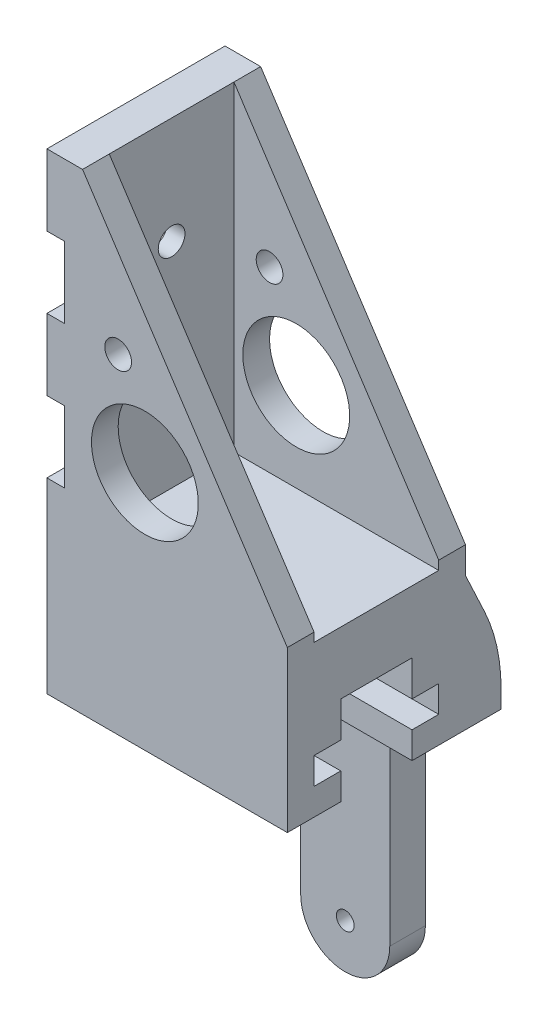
ISO-10303-21;
HEADER;
FILE_DESCRIPTION(('STEP AP214'),'2;1');
FILE_NAME('part.step','',(''),(''),'','','');
FILE_SCHEMA(('AUTOMOTIVE_DESIGN { 1 0 10303 214 1 1 1 1 }'));
ENDSEC;
DATA;
#1=APPLICATION_CONTEXT('core data for automotive mechanical design processes');
#2=APPLICATION_PROTOCOL_DEFINITION('international standard','automotive_design',2000,#1);
#3=PRODUCT_CONTEXT('',#1,'mechanical');
#4=PRODUCT('Part','Part','',(#3));
#5=PRODUCT_RELATED_PRODUCT_CATEGORY('part','',(#4));
#6=PRODUCT_DEFINITION_FORMATION('','',#4);
#7=PRODUCT_DEFINITION_CONTEXT('part definition',#1,'design');
#8=PRODUCT_DEFINITION('design','',#6,#7);
#9=PRODUCT_DEFINITION_SHAPE('','',#8);
#10=(LENGTH_UNIT() NAMED_UNIT(*) SI_UNIT(.MILLI.,.METRE.));
#11=(NAMED_UNIT(*) PLANE_ANGLE_UNIT() SI_UNIT($,.RADIAN.));
#12=(NAMED_UNIT(*) SI_UNIT($,.STERADIAN.) SOLID_ANGLE_UNIT());
#13=UNCERTAINTY_MEASURE_WITH_UNIT(LENGTH_MEASURE(1.E-05),#10,'distance_accuracy_value','');
#14=(GEOMETRIC_REPRESENTATION_CONTEXT(3) GLOBAL_UNCERTAINTY_ASSIGNED_CONTEXT((#13)) GLOBAL_UNIT_ASSIGNED_CONTEXT((#10,
#11,#12)) REPRESENTATION_CONTEXT('',''));
#15=CARTESIAN_POINT('',(0.,0.,0.));
#16=DIRECTION('',(0.,0.,1.));
#17=DIRECTION('',(1.,0.,0.));
#18=AXIS2_PLACEMENT_3D('',#15,#16,#17);
#19=CARTESIAN_POINT('',(0.,-38.,10.));
#20=DIRECTION('',(1.,0.,0.));
#21=DIRECTION('',(0.,0.,-1.));
#22=AXIS2_PLACEMENT_3D('',#19,#20,#21);
#23=PLANE('',#22);
#24=CARTESIAN_POINT('',(0.,-28.,0.));
#25=DIRECTION('',(-1.,0.,0.));
#26=DIRECTION('',(0.,0.,1.));
#27=AXIS2_PLACEMENT_3D('',#24,#25,#26);
#28=CIRCLE('',#27,1.5);
#29=CARTESIAN_POINT('',(0.,-28.,1.5));
#30=VERTEX_POINT('',#29);
#31=EDGE_CURVE('E423',#30,#30,#28,.T.);
#32=ORIENTED_EDGE('',*,*,#31,.F.);
#33=EDGE_LOOP('',(#32));
#34=FACE_BOUND('',#33,.T.);
#35=DIRECTION('',(0.,0.,-1.));
#36=VECTOR('',#35,1.);
#37=CARTESIAN_POINT('',(0.,-32.,10.));
#38=LINE('',#37,#36);
#39=CARTESIAN_POINT('',(0.,-32.,10.));
#40=VERTEX_POINT('',#39);
#41=CARTESIAN_POINT('',(0.,-32.,-10.));
#42=VERTEX_POINT('',#41);
#43=EDGE_CURVE('E461',#40,#42,#38,.T.);
#44=ORIENTED_EDGE('',*,*,#43,.F.);
#45=DIRECTION('',(0.,-1.,0.));
#46=VECTOR('',#45,1.);
#47=CARTESIAN_POINT('',(0.,-38.,10.));
#48=LINE('',#47,#46);
#49=CARTESIAN_POINT('',(0.,-24.,10.));
#50=VERTEX_POINT('',#49);
#51=EDGE_CURVE('E500',#50,#40,#48,.T.);
#52=ORIENTED_EDGE('',*,*,#51,.F.);
#53=DIRECTION('',(0.,0.,-1.));
#54=VECTOR('',#53,1.);
#55=CARTESIAN_POINT('',(0.,-24.,10.));
#56=LINE('',#55,#54);
#57=CARTESIAN_POINT('',(0.,-24.,-10.));
#58=VERTEX_POINT('',#57);
#59=EDGE_CURVE('E496',#50,#58,#56,.T.);
#60=ORIENTED_EDGE('',*,*,#59,.T.);
#61=DIRECTION('',(0.,-1.,0.));
#62=VECTOR('',#61,1.);
#63=CARTESIAN_POINT('',(0.,-38.,-10.));
#64=LINE('',#63,#62);
#65=EDGE_CURVE('E549',#58,#42,#64,.T.);
#66=ORIENTED_EDGE('',*,*,#65,.T.);
#67=EDGE_LOOP('',(#44,#52,#60,#66));
#68=FACE_BOUND('',#67,.T.);
#69=ADVANCED_FACE('F35',(#34,#68),#23,.F.);
#70=CARTESIAN_POINT('',(0.,-12.,0.));
#71=DIRECTION('',(-1.,0.,0.));
#72=DIRECTION('',(0.,0.,1.));
#73=AXIS2_PLACEMENT_3D('',#70,#71,#72);
#74=CIRCLE('',#73,1.5);
#75=CARTESIAN_POINT('',(0.,-12.,1.5));
#76=VERTEX_POINT('',#75);
#77=EDGE_CURVE('E426',#76,#76,#74,.T.);
#78=ORIENTED_EDGE('',*,*,#77,.F.);
#79=EDGE_LOOP('',(#78));
#80=FACE_BOUND('',#79,.T.);
#81=DIRECTION('',(0.,0.,-1.));
#82=VECTOR('',#81,1.);
#83=CARTESIAN_POINT('',(0.,-8.,10.));
#84=LINE('',#83,#82);
#85=CARTESIAN_POINT('',(0.,-8.,10.));
#86=VERTEX_POINT('',#85);
#87=CARTESIAN_POINT('',(0.,-8.,-10.));
#88=VERTEX_POINT('',#87);
#89=EDGE_CURVE('E471',#86,#88,#84,.T.);
#90=ORIENTED_EDGE('',*,*,#89,.T.);
#91=CARTESIAN_POINT('',(0.,-16.,-10.));
#92=VERTEX_POINT('',#91);
#93=EDGE_CURVE('E559',#88,#92,#64,.T.);
#94=ORIENTED_EDGE('',*,*,#93,.T.);
#95=DIRECTION('',(0.,0.,-1.));
#96=VECTOR('',#95,1.);
#97=CARTESIAN_POINT('',(0.,-16.,10.));
#98=LINE('',#97,#96);
#99=CARTESIAN_POINT('',(0.,-16.,10.));
#100=VERTEX_POINT('',#99);
#101=EDGE_CURVE('E512',#100,#92,#98,.T.);
#102=ORIENTED_EDGE('',*,*,#101,.F.);
#103=EDGE_CURVE('E556',#86,#100,#48,.T.);
#104=ORIENTED_EDGE('',*,*,#103,.F.);
#105=EDGE_LOOP('',(#90,#94,#102,#104));
#106=FACE_BOUND('',#105,.T.);
#107=ADVANCED_FACE('F587',(#80,#106),#23,.F.);
#108=CARTESIAN_POINT('',(2.,0.,10.));
#109=DIRECTION('',(-0.835705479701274,-0.549177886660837,0.));
#110=DIRECTION('',(0.549177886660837,-0.835705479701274,0.));
#111=AXIS2_PLACEMENT_3D('',#108,#109,#110);
#112=PLANE('',#111);
#113=DIRECTION('',(-0.549177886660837,0.835705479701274,0.));
#114=VECTOR('',#113,1.);
#115=CARTESIAN_POINT('',(1.39680729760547,0.917901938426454,-7.));
#116=LINE('',#115,#114);
#117=CARTESIAN_POINT('',(25.,-35.,-7.));
#118=VERTEX_POINT('',#117);
#119=CARTESIAN_POINT('',(2.,0.,-7.));
#120=VERTEX_POINT('',#119);
#121=EDGE_CURVE('E541',#118,#120,#116,.T.);
#122=ORIENTED_EDGE('',*,*,#121,.F.);
#123=DIRECTION('',(0.,0.,-1.));
#124=VECTOR('',#123,1.);
#125=CARTESIAN_POINT('',(25.,-35.,10.));
#126=LINE('',#125,#124);
#127=CARTESIAN_POINT('',(25.,-35.,-10.));
#128=VERTEX_POINT('',#127);
#129=EDGE_CURVE('E43',#118,#128,#126,.T.);
#130=ORIENTED_EDGE('',*,*,#129,.T.);
#131=DIRECTION('',(-0.549177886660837,0.835705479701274,0.));
#132=VECTOR('',#131,1.);
#133=CARTESIAN_POINT('',(2.,0.,-10.));
#134=LINE('',#133,#132);
#135=CARTESIAN_POINT('',(2.,0.,-10.));
#136=VERTEX_POINT('',#135);
#137=EDGE_CURVE('E640',#128,#136,#134,.T.);
#138=ORIENTED_EDGE('',*,*,#137,.T.);
#139=DIRECTION('',(0.,0.,-1.));
#140=VECTOR('',#139,1.);
#141=CARTESIAN_POINT('',(2.,0.,10.));
#142=LINE('',#141,#140);
#143=EDGE_CURVE('E628',#120,#136,#142,.T.);
#144=ORIENTED_EDGE('',*,*,#143,.F.);
#145=EDGE_LOOP('',(#122,#130,#138,#144));
#146=FACE_BOUND('',#145,.T.);
#147=ADVANCED_FACE('F592',(#146),#112,.F.);
#148=CARTESIAN_POINT('',(25.,-35.,10.));
#149=DIRECTION('',(-1.,0.,0.));
#150=DIRECTION('',(0.,0.,1.));
#151=AXIS2_PLACEMENT_3D('',#148,#149,#150);
#152=PLANE('',#151);
#153=DIRECTION('',(0.,1.,0.));
#154=VECTOR('',#153,1.);
#155=CARTESIAN_POINT('',(25.,-36.,-7.));
#156=LINE('',#155,#154);
#157=CARTESIAN_POINT('',(25.,-36.,-7.));
#158=VERTEX_POINT('',#157);
#159=EDGE_CURVE('E524',#158,#118,#156,.T.);
#160=ORIENTED_EDGE('',*,*,#159,.F.);
#161=DIRECTION('',(0.,0.,1.));
#162=VECTOR('',#161,1.);
#163=CARTESIAN_POINT('',(25.,-36.,-7.));
#164=LINE('',#163,#162);
#165=CARTESIAN_POINT('',(25.,-36.,7.));
#166=VERTEX_POINT('',#165);
#167=EDGE_CURVE('E531',#158,#166,#164,.T.);
#168=ORIENTED_EDGE('',*,*,#167,.T.);
#169=DIRECTION('',(0.,1.,0.));
#170=VECTOR('',#169,1.);
#171=CARTESIAN_POINT('',(25.,-36.,7.));
#172=LINE('',#171,#170);
#173=CARTESIAN_POINT('',(25.,-35.,7.));
#174=VERTEX_POINT('',#173);
#175=EDGE_CURVE('E534',#166,#174,#172,.T.);
#176=ORIENTED_EDGE('',*,*,#175,.T.);
#177=CARTESIAN_POINT('',(25.,-35.,10.));
#178=VERTEX_POINT('',#177);
#179=EDGE_CURVE('E11',#178,#174,#126,.T.);
#180=ORIENTED_EDGE('',*,*,#179,.F.);
#181=DIRECTION('',(0.,1.,0.));
#182=VECTOR('',#181,1.);
#183=CARTESIAN_POINT('',(25.,-35.,10.));
#184=LINE('',#183,#182);
#185=CARTESIAN_POINT('',(25.,-53.,10.));
#186=VERTEX_POINT('',#185);
#187=EDGE_CURVE('E552',#186,#178,#184,.T.);
#188=ORIENTED_EDGE('',*,*,#187,.F.);
#189=DIRECTION('',(0.,0.,-1.));
#190=VECTOR('',#189,1.);
#191=CARTESIAN_POINT('',(25.,-53.,4.));
#192=LINE('',#191,#190);
#193=CARTESIAN_POINT('',(25.,-53.,4.));
#194=VERTEX_POINT('',#193);
#195=EDGE_CURVE('E347',#186,#194,#192,.T.);
#196=ORIENTED_EDGE('',*,*,#195,.T.);
#197=DIRECTION('',(0.,1.,0.));
#198=VECTOR('',#197,1.);
#199=CARTESIAN_POINT('',(25.,-50.,4.));
#200=LINE('',#199,#198);
#201=CARTESIAN_POINT('',(25.,-50.,4.));
#202=VERTEX_POINT('',#201);
#203=EDGE_CURVE('E350',#194,#202,#200,.T.);
#204=ORIENTED_EDGE('',*,*,#203,.T.);
#205=DIRECTION('',(0.,0.,1.));
#206=VECTOR('',#205,1.);
#207=CARTESIAN_POINT('',(25.,-50.,7.));
#208=LINE('',#207,#206);
#209=CARTESIAN_POINT('',(25.,-50.,7.));
#210=VERTEX_POINT('',#209);
#211=EDGE_CURVE('E353',#202,#210,#208,.T.);
#212=ORIENTED_EDGE('',*,*,#211,.T.);
#213=DIRECTION('',(0.,1.,0.));
#214=VECTOR('',#213,1.);
#215=CARTESIAN_POINT('',(25.,-47.,7.));
#216=LINE('',#215,#214);
#217=CARTESIAN_POINT('',(25.,-47.,7.));
#218=VERTEX_POINT('',#217);
#219=EDGE_CURVE('E356',#210,#218,#216,.T.);
#220=ORIENTED_EDGE('',*,*,#219,.T.);
#221=DIRECTION('',(0.,0.,-1.));
#222=VECTOR('',#221,1.);
#223=CARTESIAN_POINT('',(25.,-47.,4.));
#224=LINE('',#223,#222);
#225=CARTESIAN_POINT('',(25.,-47.,4.));
#226=VERTEX_POINT('',#225);
#227=EDGE_CURVE('E359',#218,#226,#224,.T.);
#228=ORIENTED_EDGE('',*,*,#227,.T.);
#229=DIRECTION('',(0.,1.,0.));
#230=VECTOR('',#229,1.);
#231=CARTESIAN_POINT('',(25.,-43.,4.));
#232=LINE('',#231,#230);
#233=CARTESIAN_POINT('',(25.,-43.,4.));
#234=VERTEX_POINT('',#233);
#235=EDGE_CURVE('E362',#226,#234,#232,.T.);
#236=ORIENTED_EDGE('',*,*,#235,.T.);
#237=DIRECTION('',(0.,0.,-1.));
#238=VECTOR('',#237,1.);
#239=CARTESIAN_POINT('',(25.,-43.,4.));
#240=LINE('',#239,#238);
#241=CARTESIAN_POINT('',(25.,-43.,-4.));
#242=VERTEX_POINT('',#241);
#243=EDGE_CURVE('E365',#234,#242,#240,.T.);
#244=ORIENTED_EDGE('',*,*,#243,.T.);
#245=DIRECTION('',(0.,-1.,0.));
#246=VECTOR('',#245,1.);
#247=CARTESIAN_POINT('',(25.,-43.,-4.));
#248=LINE('',#247,#246);
#249=CARTESIAN_POINT('',(25.,-47.,-4.));
#250=VERTEX_POINT('',#249);
#251=EDGE_CURVE('E368',#242,#250,#248,.T.);
#252=ORIENTED_EDGE('',*,*,#251,.T.);
#253=DIRECTION('',(0.,0.,-1.));
#254=VECTOR('',#253,1.);
#255=CARTESIAN_POINT('',(25.,-47.,-4.));
#256=LINE('',#255,#254);
#257=CARTESIAN_POINT('',(25.,-47.,-7.));
#258=VERTEX_POINT('',#257);
#259=EDGE_CURVE('E371',#250,#258,#256,.T.);
#260=ORIENTED_EDGE('',*,*,#259,.T.);
#261=DIRECTION('',(0.,-1.,0.));
#262=VECTOR('',#261,1.);
#263=CARTESIAN_POINT('',(25.,-47.,-7.));
#264=LINE('',#263,#262);
#265=CARTESIAN_POINT('',(25.,-50.,-7.));
#266=VERTEX_POINT('',#265);
#267=EDGE_CURVE('E374',#258,#266,#264,.T.);
#268=ORIENTED_EDGE('',*,*,#267,.T.);
#269=DIRECTION('',(0.,0.,1.));
#270=VECTOR('',#269,1.);
#271=CARTESIAN_POINT('',(25.,-50.,-7.));
#272=LINE('',#271,#270);
#273=CARTESIAN_POINT('',(25.,-50.,-4.));
#274=VERTEX_POINT('',#273);
#275=EDGE_CURVE('E377',#266,#274,#272,.T.);
#276=ORIENTED_EDGE('',*,*,#275,.T.);
#277=DIRECTION('',(0.,-1.,0.));
#278=VECTOR('',#277,1.);
#279=CARTESIAN_POINT('',(25.,-50.,-4.));
#280=LINE('',#279,#278);
#281=CARTESIAN_POINT('',(25.,-53.,-4.));
#282=VERTEX_POINT('',#281);
#283=EDGE_CURVE('E380',#274,#282,#280,.T.);
#284=ORIENTED_EDGE('',*,*,#283,.T.);
#285=DIRECTION('',(0.,0.,-1.));
#286=VECTOR('',#285,1.);
#287=CARTESIAN_POINT('',(25.,-53.,-14.));
#288=LINE('',#287,#286);
#289=CARTESIAN_POINT('',(25.,-53.,-14.));
#290=VERTEX_POINT('',#289);
#291=EDGE_CURVE('E383',#282,#290,#288,.T.);
#292=ORIENTED_EDGE('',*,*,#291,.T.);
#293=DIRECTION('',(0.,1.,0.));
#294=VECTOR('',#293,1.);
#295=CARTESIAN_POINT('',(25.,-51.,-14.));
#296=LINE('',#295,#294);
#297=CARTESIAN_POINT('',(25.,-51.,-14.));
#298=VERTEX_POINT('',#297);
#299=EDGE_CURVE('E386',#290,#298,#296,.T.);
#300=ORIENTED_EDGE('',*,*,#299,.T.);
#301=CARTESIAN_POINT('',(25.,-51.,6.));
#302=DIRECTION('',(1.,0.,0.));
#303=DIRECTION('',(0.,0.,-1.));
#304=AXIS2_PLACEMENT_3D('',#301,#302,#303);
#305=CIRCLE('',#304,20.);
#306=CARTESIAN_POINT('',(25.,-42.5294117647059,-12.1176470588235));
#307=VERTEX_POINT('',#306);
#308=EDGE_CURVE('E307',#298,#307,#305,.T.);
#309=ORIENTED_EDGE('',*,*,#308,.T.);
#310=DIRECTION('',(0.,0.905882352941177,0.423529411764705));
#311=VECTOR('',#310,1.);
#312=CARTESIAN_POINT('',(25.,-38.,-10.));
#313=LINE('',#312,#311);
#314=CARTESIAN_POINT('',(25.,-38.,-10.));
#315=VERTEX_POINT('',#314);
#316=EDGE_CURVE('E344',#307,#315,#313,.T.);
#317=ORIENTED_EDGE('',*,*,#316,.T.);
#318=DIRECTION('',(0.,1.,0.));
#319=VECTOR('',#318,1.);
#320=CARTESIAN_POINT('',(25.,-35.,-10.));
#321=LINE('',#320,#319);
#322=EDGE_CURVE('E642',#315,#128,#321,.T.);
#323=ORIENTED_EDGE('',*,*,#322,.T.);
#324=ORIENTED_EDGE('',*,*,#129,.F.);
#325=EDGE_LOOP('',(#160,#168,#176,#180,#188,#196,#204,#212,#220,#228,#236,#244,#252,#260,#268,
#276,#284,#292,#300,#309,#317,#323,#324));
#326=FACE_BOUND('',#325,.T.);
#327=ADVANCED_FACE('F623',(#326),#152,.F.);
#328=ORIENTED_EDGE('',*,*,#179,.T.);
#329=DIRECTION('',(-0.549177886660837,0.835705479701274,0.));
#330=VECTOR('',#329,1.);
#331=CARTESIAN_POINT('',(1.39680729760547,0.917901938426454,7.));
#332=LINE('',#331,#330);
#333=CARTESIAN_POINT('',(2.,0.,7.));
#334=VERTEX_POINT('',#333);
#335=EDGE_CURVE('E548',#174,#334,#332,.T.);
#336=ORIENTED_EDGE('',*,*,#335,.T.);
#337=CARTESIAN_POINT('',(2.,0.,10.));
#338=VERTEX_POINT('',#337);
#339=EDGE_CURVE('E636',#338,#334,#142,.T.);
#340=ORIENTED_EDGE('',*,*,#339,.F.);
#341=DIRECTION('',(-0.549177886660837,0.835705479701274,0.));
#342=VECTOR('',#341,1.);
#343=CARTESIAN_POINT('',(2.,0.,10.));
#344=LINE('',#343,#342);
#345=EDGE_CURVE('E625',#178,#338,#344,.T.);
#346=ORIENTED_EDGE('',*,*,#345,.F.);
#347=EDGE_LOOP('',(#328,#336,#340,#346));
#348=FACE_BOUND('',#347,.T.);
#349=ADVANCED_FACE('F939',(#348),#112,.F.);
#350=CARTESIAN_POINT('',(0.,0.,10.));
#351=DIRECTION('',(0.,-1.,0.));
#352=DIRECTION('',(0.,0.,-1.));
#353=AXIS2_PLACEMENT_3D('',#350,#351,#352);
#354=PLANE('',#353);
#355=DIRECTION('',(-1.,0.,0.));
#356=VECTOR('',#355,1.);
#357=CARTESIAN_POINT('',(0.,0.,-10.));
#358=LINE('',#357,#356);
#359=CARTESIAN_POINT('',(-2.,0.,-10.));
#360=VERTEX_POINT('',#359);
#361=EDGE_CURVE('E607',#136,#360,#358,.T.);
#362=ORIENTED_EDGE('',*,*,#361,.T.);
#363=DIRECTION('',(0.,0.,-1.));
#364=VECTOR('',#363,1.);
#365=CARTESIAN_POINT('',(-2.,0.,10.));
#366=LINE('',#365,#364);
#367=CARTESIAN_POINT('',(-2.,0.,10.));
#368=VERTEX_POINT('',#367);
#369=EDGE_CURVE('E480',#368,#360,#366,.T.);
#370=ORIENTED_EDGE('',*,*,#369,.F.);
#371=DIRECTION('',(-1.,0.,0.));
#372=VECTOR('',#371,1.);
#373=CARTESIAN_POINT('',(0.,0.,10.));
#374=LINE('',#373,#372);
#375=EDGE_CURVE('E626',#338,#368,#374,.T.);
#376=ORIENTED_EDGE('',*,*,#375,.F.);
#377=ORIENTED_EDGE('',*,*,#339,.T.);
#378=DIRECTION('',(0.,0.,1.));
#379=VECTOR('',#378,1.);
#380=CARTESIAN_POINT('',(2.,0.,-7.));
#381=LINE('',#380,#379);
#382=EDGE_CURVE('E542',#120,#334,#381,.T.);
#383=ORIENTED_EDGE('',*,*,#382,.F.);
#384=ORIENTED_EDGE('',*,*,#143,.T.);
#385=EDGE_LOOP('',(#362,#370,#376,#377,#383,#384));
#386=FACE_BOUND('',#385,.T.);
#387=ADVANCED_FACE('F679',(#386),#354,.F.);
#388=CARTESIAN_POINT('',(0.,0.,10.));
#389=DIRECTION('',(0.,0.,-1.));
#390=DIRECTION('',(-1.,0.,0.));
#391=AXIS2_PLACEMENT_3D('',#388,#389,#390);
#392=PLANE('',#391);
#393=CARTESIAN_POINT('',(6.,-16.,10.));
#394=DIRECTION('',(0.,0.,-1.));
#395=DIRECTION('',(-1.,0.,0.));
#396=AXIS2_PLACEMENT_3D('',#393,#394,#395);
#397=CIRCLE('',#396,1.5);
#398=CARTESIAN_POINT('',(4.5,-16.,10.));
#399=VERTEX_POINT('',#398);
#400=EDGE_CURVE('E430',#399,#399,#397,.T.);
#401=ORIENTED_EDGE('',*,*,#400,.T.);
#402=EDGE_LOOP('',(#401));
#403=FACE_BOUND('',#402,.T.);
#404=CARTESIAN_POINT('',(9.,-26.,10.));
#405=DIRECTION('',(0.,0.,-1.));
#406=DIRECTION('',(-1.,0.,0.));
#407=AXIS2_PLACEMENT_3D('',#404,#405,#406);
#408=CIRCLE('',#407,6.);
#409=CARTESIAN_POINT('',(3.,-26.,10.));
#410=VERTEX_POINT('',#409);
#411=EDGE_CURVE('E441',#410,#410,#408,.T.);
#412=ORIENTED_EDGE('',*,*,#411,.T.);
#413=EDGE_LOOP('',(#412));
#414=FACE_BOUND('',#413,.T.);
#415=ORIENTED_EDGE('',*,*,#375,.T.);
#416=DIRECTION('',(0.,-1.,0.));
#417=VECTOR('',#416,1.);
#418=CARTESIAN_POINT('',(-2.,0.,10.));
#419=LINE('',#418,#417);
#420=CARTESIAN_POINT('',(-2.,-8.,10.));
#421=VERTEX_POINT('',#420);
#422=EDGE_CURVE('E465',#368,#421,#419,.T.);
#423=ORIENTED_EDGE('',*,*,#422,.T.);
#424=DIRECTION('',(1.,0.,0.));
#425=VECTOR('',#424,1.);
#426=CARTESIAN_POINT('',(0.,-8.,10.));
#427=LINE('',#426,#425);
#428=EDGE_CURVE('E467',#421,#86,#427,.T.);
#429=ORIENTED_EDGE('',*,*,#428,.T.);
#430=ORIENTED_EDGE('',*,*,#103,.T.);
#431=DIRECTION('',(-1.,0.,0.));
#432=VECTOR('',#431,1.);
#433=CARTESIAN_POINT('',(0.,-16.,10.));
#434=LINE('',#433,#432);
#435=CARTESIAN_POINT('',(-2.,-16.,10.));
#436=VERTEX_POINT('',#435);
#437=EDGE_CURVE('E487',#100,#436,#434,.T.);
#438=ORIENTED_EDGE('',*,*,#437,.T.);
#439=DIRECTION('',(0.,-1.,0.));
#440=VECTOR('',#439,1.);
#441=CARTESIAN_POINT('',(-2.,-16.,10.));
#442=LINE('',#441,#440);
#443=CARTESIAN_POINT('',(-2.,-24.,10.));
#444=VERTEX_POINT('',#443);
#445=EDGE_CURVE('E484',#436,#444,#442,.T.);
#446=ORIENTED_EDGE('',*,*,#445,.T.);
#447=DIRECTION('',(1.,0.,0.));
#448=VECTOR('',#447,1.);
#449=CARTESIAN_POINT('',(0.,-24.,10.));
#450=LINE('',#449,#448);
#451=EDGE_CURVE('E486',#444,#50,#450,.T.);
#452=ORIENTED_EDGE('',*,*,#451,.T.);
#453=ORIENTED_EDGE('',*,*,#51,.T.);
#454=DIRECTION('',(-1.,0.,0.));
#455=VECTOR('',#454,1.);
#456=CARTESIAN_POINT('',(0.,-32.,10.));
#457=LINE('',#456,#455);
#458=CARTESIAN_POINT('',(-2.,-32.,10.));
#459=VERTEX_POINT('',#458);
#460=EDGE_CURVE('E451',#40,#459,#457,.T.);
#461=ORIENTED_EDGE('',*,*,#460,.T.);
#462=DIRECTION('',(0.,-1.,0.));
#463=VECTOR('',#462,1.);
#464=CARTESIAN_POINT('',(-2.,-32.,10.));
#465=LINE('',#464,#463);
#466=CARTESIAN_POINT('',(-2.,-53.,10.));
#467=VERTEX_POINT('',#466);
#468=EDGE_CURVE('E453',#459,#467,#465,.T.);
#469=ORIENTED_EDGE('',*,*,#468,.T.);
#470=DIRECTION('',(1.,0.,0.));
#471=VECTOR('',#470,1.);
#472=CARTESIAN_POINT('',(-30.3019433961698,-53.,10.));
#473=LINE('',#472,#471);
#474=EDGE_CURVE('E418',#467,#186,#473,.T.);
#475=ORIENTED_EDGE('',*,*,#474,.T.);
#476=ORIENTED_EDGE('',*,*,#187,.T.);
#477=ORIENTED_EDGE('',*,*,#345,.T.);
#478=EDGE_LOOP('',(#415,#423,#429,#430,#438,#446,#452,#453,#461,#469,#475,#476,#477));
#479=FACE_BOUND('',#478,.T.);
#480=ADVANCED_FACE('F603',(#403,#414,#479),#392,.F.);
#481=CARTESIAN_POINT('',(0.,0.,-10.));
#482=DIRECTION('',(0.,0.,-1.));
#483=DIRECTION('',(-1.,0.,0.));
#484=AXIS2_PLACEMENT_3D('',#481,#482,#483);
#485=PLANE('',#484);
#486=CARTESIAN_POINT('',(6.,-16.,-10.));
#487=DIRECTION('',(0.,0.,-1.));
#488=DIRECTION('',(-1.,0.,0.));
#489=AXIS2_PLACEMENT_3D('',#486,#487,#488);
#490=CIRCLE('',#489,1.5);
#491=CARTESIAN_POINT('',(4.5,-16.,-10.));
#492=VERTEX_POINT('',#491);
#493=EDGE_CURVE('E434',#492,#492,#490,.T.);
#494=ORIENTED_EDGE('',*,*,#493,.F.);
#495=EDGE_LOOP('',(#494));
#496=FACE_BOUND('',#495,.T.);
#497=CARTESIAN_POINT('',(9.,-26.,-10.));
#498=DIRECTION('',(0.,0.,-1.));
#499=DIRECTION('',(-1.,0.,0.));
#500=AXIS2_PLACEMENT_3D('',#497,#498,#499);
#501=CIRCLE('',#500,6.);
#502=CARTESIAN_POINT('',(3.,-26.,-10.));
#503=VERTEX_POINT('',#502);
#504=EDGE_CURVE('E440',#503,#503,#501,.T.);
#505=ORIENTED_EDGE('',*,*,#504,.F.);
#506=EDGE_LOOP('',(#505));
#507=FACE_BOUND('',#506,.T.);
#508=ORIENTED_EDGE('',*,*,#93,.F.);
#509=DIRECTION('',(1.,0.,0.));
#510=VECTOR('',#509,1.);
#511=CARTESIAN_POINT('',(0.,-8.,-10.));
#512=LINE('',#511,#510);
#513=CARTESIAN_POINT('',(-2.,-8.,-10.));
#514=VERTEX_POINT('',#513);
#515=EDGE_CURVE('E468',#514,#88,#512,.T.);
#516=ORIENTED_EDGE('',*,*,#515,.F.);
#517=DIRECTION('',(0.,-1.,0.));
#518=VECTOR('',#517,1.);
#519=CARTESIAN_POINT('',(-2.,0.,-10.));
#520=LINE('',#519,#518);
#521=EDGE_CURVE('E464',#360,#514,#520,.T.);
#522=ORIENTED_EDGE('',*,*,#521,.F.);
#523=ORIENTED_EDGE('',*,*,#361,.F.);
#524=ORIENTED_EDGE('',*,*,#137,.F.);
#525=ORIENTED_EDGE('',*,*,#322,.F.);
#526=DIRECTION('',(1.,0.,0.));
#527=VECTOR('',#526,1.);
#528=CARTESIAN_POINT('',(25.,-38.,-10.));
#529=LINE('',#528,#527);
#530=CARTESIAN_POINT('',(-2.,-38.,-10.));
#531=VERTEX_POINT('',#530);
#532=EDGE_CURVE('E632',#531,#315,#529,.T.);
#533=ORIENTED_EDGE('',*,*,#532,.F.);
#534=DIRECTION('',(0.,-1.,0.));
#535=VECTOR('',#534,1.);
#536=CARTESIAN_POINT('',(-2.,-32.,-10.));
#537=LINE('',#536,#535);
#538=CARTESIAN_POINT('',(-2.,-32.,-10.));
#539=VERTEX_POINT('',#538);
#540=EDGE_CURVE('E454',#539,#531,#537,.T.);
#541=ORIENTED_EDGE('',*,*,#540,.F.);
#542=DIRECTION('',(-1.,0.,0.));
#543=VECTOR('',#542,1.);
#544=CARTESIAN_POINT('',(0.,-32.,-10.));
#545=LINE('',#544,#543);
#546=EDGE_CURVE('E450',#42,#539,#545,.T.);
#547=ORIENTED_EDGE('',*,*,#546,.F.);
#548=ORIENTED_EDGE('',*,*,#65,.F.);
#549=DIRECTION('',(1.,0.,0.));
#550=VECTOR('',#549,1.);
#551=CARTESIAN_POINT('',(0.,-24.,-10.));
#552=LINE('',#551,#550);
#553=CARTESIAN_POINT('',(-2.,-24.,-10.));
#554=VERTEX_POINT('',#553);
#555=EDGE_CURVE('E490',#554,#58,#552,.T.);
#556=ORIENTED_EDGE('',*,*,#555,.F.);
#557=DIRECTION('',(0.,-1.,0.));
#558=VECTOR('',#557,1.);
#559=CARTESIAN_POINT('',(-2.,-16.,-10.));
#560=LINE('',#559,#558);
#561=CARTESIAN_POINT('',(-2.,-16.,-10.));
#562=VERTEX_POINT('',#561);
#563=EDGE_CURVE('E488',#562,#554,#560,.T.);
#564=ORIENTED_EDGE('',*,*,#563,.F.);
#565=DIRECTION('',(-1.,0.,0.));
#566=VECTOR('',#565,1.);
#567=CARTESIAN_POINT('',(0.,-16.,-10.));
#568=LINE('',#567,#566);
#569=EDGE_CURVE('E483',#92,#562,#568,.T.);
#570=ORIENTED_EDGE('',*,*,#569,.F.);
#571=EDGE_LOOP('',(#508,#516,#522,#523,#524,#525,#533,#541,#547,#548,#556,#564,#570));
#572=FACE_BOUND('',#571,.T.);
#573=ADVANCED_FACE('F658',(#496,#507,#572),#485,.T.);
#574=CARTESIAN_POINT('',(0.,0.,7.));
#575=DIRECTION('',(0.,0.,-1.));
#576=DIRECTION('',(-1.,0.,0.));
#577=AXIS2_PLACEMENT_3D('',#574,#575,#576);
#578=PLANE('',#577);
#579=CARTESIAN_POINT('',(6.,-16.,7.));
#580=DIRECTION('',(0.,0.,-1.));
#581=DIRECTION('',(-1.,0.,0.));
#582=AXIS2_PLACEMENT_3D('',#579,#580,#581);
#583=CIRCLE('',#582,1.5);
#584=CARTESIAN_POINT('',(4.5,-16.,7.));
#585=VERTEX_POINT('',#584);
#586=EDGE_CURVE('E437',#585,#585,#583,.T.);
#587=ORIENTED_EDGE('',*,*,#586,.F.);
#588=EDGE_LOOP('',(#587));
#589=FACE_BOUND('',#588,.T.);
#590=CARTESIAN_POINT('',(9.,-26.,7.));
#591=DIRECTION('',(0.,0.,-1.));
#592=DIRECTION('',(-1.,0.,0.));
#593=AXIS2_PLACEMENT_3D('',#590,#591,#592);
#594=CIRCLE('',#593,6.);
#595=CARTESIAN_POINT('',(3.,-26.,7.));
#596=VERTEX_POINT('',#595);
#597=EDGE_CURVE('E447',#596,#596,#594,.T.);
#598=ORIENTED_EDGE('',*,*,#597,.F.);
#599=EDGE_LOOP('',(#598));
#600=FACE_BOUND('',#599,.T.);
#601=DIRECTION('',(0.,-1.,0.));
#602=VECTOR('',#601,1.);
#603=CARTESIAN_POINT('',(2.,0.,7.));
#604=LINE('',#603,#602);
#605=CARTESIAN_POINT('',(2.,-36.,7.));
#606=VERTEX_POINT('',#605);
#607=EDGE_CURVE('E525',#334,#606,#604,.T.);
#608=ORIENTED_EDGE('',*,*,#607,.F.);
#609=ORIENTED_EDGE('',*,*,#335,.F.);
#610=ORIENTED_EDGE('',*,*,#175,.F.);
#611=DIRECTION('',(1.,0.,0.));
#612=VECTOR('',#611,1.);
#613=CARTESIAN_POINT('',(2.,-36.,7.));
#614=LINE('',#613,#612);
#615=EDGE_CURVE('E516',#606,#166,#614,.T.);
#616=ORIENTED_EDGE('',*,*,#615,.F.);
#617=EDGE_LOOP('',(#608,#609,#610,#616));
#618=FACE_BOUND('',#617,.T.);
#619=ADVANCED_FACE('F989',(#589,#600,#618),#578,.T.);
#620=CARTESIAN_POINT('',(0.,0.,-7.));
#621=DIRECTION('',(0.,0.,-1.));
#622=DIRECTION('',(-1.,0.,0.));
#623=AXIS2_PLACEMENT_3D('',#620,#621,#622);
#624=PLANE('',#623);
#625=CARTESIAN_POINT('',(6.,-16.,-7.));
#626=DIRECTION('',(0.,0.,-1.));
#627=DIRECTION('',(-1.,0.,0.));
#628=AXIS2_PLACEMENT_3D('',#625,#626,#627);
#629=CIRCLE('',#628,1.5);
#630=CARTESIAN_POINT('',(4.5,-16.,-7.));
#631=VERTEX_POINT('',#630);
#632=EDGE_CURVE('E433',#631,#631,#629,.T.);
#633=ORIENTED_EDGE('',*,*,#632,.T.);
#634=EDGE_LOOP('',(#633));
#635=FACE_BOUND('',#634,.T.);
#636=CARTESIAN_POINT('',(9.,-26.,-7.));
#637=DIRECTION('',(0.,0.,-1.));
#638=DIRECTION('',(-1.,0.,0.));
#639=AXIS2_PLACEMENT_3D('',#636,#637,#638);
#640=CIRCLE('',#639,6.);
#641=CARTESIAN_POINT('',(3.,-26.,-7.));
#642=VERTEX_POINT('',#641);
#643=EDGE_CURVE('E444',#642,#642,#640,.T.);
#644=ORIENTED_EDGE('',*,*,#643,.T.);
#645=EDGE_LOOP('',(#644));
#646=FACE_BOUND('',#645,.T.);
#647=ORIENTED_EDGE('',*,*,#121,.T.);
#648=DIRECTION('',(0.,-1.,0.));
#649=VECTOR('',#648,1.);
#650=CARTESIAN_POINT('',(2.,0.,-7.));
#651=LINE('',#650,#649);
#652=CARTESIAN_POINT('',(2.,-36.,-7.));
#653=VERTEX_POINT('',#652);
#654=EDGE_CURVE('E528',#120,#653,#651,.T.);
#655=ORIENTED_EDGE('',*,*,#654,.T.);
#656=DIRECTION('',(1.,0.,0.));
#657=VECTOR('',#656,1.);
#658=CARTESIAN_POINT('',(2.,-36.,-7.));
#659=LINE('',#658,#657);
#660=EDGE_CURVE('E521',#653,#158,#659,.T.);
#661=ORIENTED_EDGE('',*,*,#660,.T.);
#662=ORIENTED_EDGE('',*,*,#159,.T.);
#663=EDGE_LOOP('',(#647,#655,#661,#662));
#664=FACE_BOUND('',#663,.T.);
#665=ADVANCED_FACE('F983',(#635,#646,#664),#624,.F.);
#666=CARTESIAN_POINT('',(2.,-36.,-7.));
#667=DIRECTION('',(0.,-1.,0.));
#668=DIRECTION('',(0.,0.,-1.));
#669=AXIS2_PLACEMENT_3D('',#666,#667,#668);
#670=PLANE('',#669);
#671=ORIENTED_EDGE('',*,*,#615,.T.);
#672=ORIENTED_EDGE('',*,*,#167,.F.);
#673=ORIENTED_EDGE('',*,*,#660,.F.);
#674=DIRECTION('',(0.,0.,1.));
#675=VECTOR('',#674,1.);
#676=CARTESIAN_POINT('',(2.,-36.,-7.));
#677=LINE('',#676,#675);
#678=EDGE_CURVE('E539',#653,#606,#677,.T.);
#679=ORIENTED_EDGE('',*,*,#678,.T.);
#680=EDGE_LOOP('',(#671,#672,#673,#679));
#681=FACE_BOUND('',#680,.T.);
#682=ADVANCED_FACE('F988',(#681),#670,.F.);
#683=CARTESIAN_POINT('',(2.,0.,-7.));
#684=DIRECTION('',(-1.,0.,0.));
#685=DIRECTION('',(0.,-1.,0.));
#686=AXIS2_PLACEMENT_3D('',#683,#684,#685);
#687=PLANE('',#686);
#688=CARTESIAN_POINT('',(2.,-28.,0.));
#689=DIRECTION('',(-1.,0.,0.));
#690=DIRECTION('',(0.,-1.,0.));
#691=AXIS2_PLACEMENT_3D('',#688,#689,#690);
#692=CIRCLE('',#691,1.5);
#693=CARTESIAN_POINT('',(2.,-29.5,0.));
#694=VERTEX_POINT('',#693);
#695=EDGE_CURVE('E38',#694,#694,#692,.T.);
#696=ORIENTED_EDGE('',*,*,#695,.T.);
#697=EDGE_LOOP('',(#696));
#698=FACE_BOUND('',#697,.T.);
#699=CARTESIAN_POINT('',(2.,-12.,0.));
#700=DIRECTION('',(-1.,0.,0.));
#701=DIRECTION('',(0.,-1.,0.));
#702=AXIS2_PLACEMENT_3D('',#699,#700,#701);
#703=CIRCLE('',#702,1.5);
#704=CARTESIAN_POINT('',(2.,-13.5,0.));
#705=VERTEX_POINT('',#704);
#706=EDGE_CURVE('E429',#705,#705,#703,.T.);
#707=ORIENTED_EDGE('',*,*,#706,.T.);
#708=EDGE_LOOP('',(#707));
#709=FACE_BOUND('',#708,.T.);
#710=ORIENTED_EDGE('',*,*,#607,.T.);
#711=ORIENTED_EDGE('',*,*,#678,.F.);
#712=ORIENTED_EDGE('',*,*,#654,.F.);
#713=ORIENTED_EDGE('',*,*,#382,.T.);
#714=EDGE_LOOP('',(#710,#711,#712,#713));
#715=FACE_BOUND('',#714,.T.);
#716=ADVANCED_FACE('F567',(#698,#709,#715),#687,.F.);
#717=CARTESIAN_POINT('',(0.,-16.,10.));
#718=DIRECTION('',(0.,-1.,0.));
#719=DIRECTION('',(0.,0.,-1.));
#720=AXIS2_PLACEMENT_3D('',#717,#718,#719);
#721=PLANE('',#720);
#722=ORIENTED_EDGE('',*,*,#569,.T.);
#723=DIRECTION('',(0.,0.,-1.));
#724=VECTOR('',#723,1.);
#725=CARTESIAN_POINT('',(-2.,-16.,10.));
#726=LINE('',#725,#724);
#727=EDGE_CURVE('E517',#436,#562,#726,.T.);
#728=ORIENTED_EDGE('',*,*,#727,.F.);
#729=ORIENTED_EDGE('',*,*,#437,.F.);
#730=ORIENTED_EDGE('',*,*,#101,.T.);
#731=EDGE_LOOP('',(#722,#728,#729,#730));
#732=FACE_BOUND('',#731,.T.);
#733=ADVANCED_FACE('F664',(#732),#721,.F.);
#734=CARTESIAN_POINT('',(-2.,-16.,10.));
#735=DIRECTION('',(1.,0.,0.));
#736=DIRECTION('',(0.,1.,0.));
#737=AXIS2_PLACEMENT_3D('',#734,#735,#736);
#738=PLANE('',#737);
#739=ORIENTED_EDGE('',*,*,#563,.T.);
#740=DIRECTION('',(0.,0.,-1.));
#741=VECTOR('',#740,1.);
#742=CARTESIAN_POINT('',(-2.,-24.,10.));
#743=LINE('',#742,#741);
#744=EDGE_CURVE('E493',#444,#554,#743,.T.);
#745=ORIENTED_EDGE('',*,*,#744,.F.);
#746=ORIENTED_EDGE('',*,*,#445,.F.);
#747=ORIENTED_EDGE('',*,*,#727,.T.);
#748=EDGE_LOOP('',(#739,#745,#746,#747));
#749=FACE_BOUND('',#748,.T.);
#750=ADVANCED_FACE('F1036',(#749),#738,.F.);
#751=CARTESIAN_POINT('',(0.,-24.,10.));
#752=DIRECTION('',(0.,1.,0.));
#753=DIRECTION('',(0.,0.,1.));
#754=AXIS2_PLACEMENT_3D('',#751,#752,#753);
#755=PLANE('',#754);
#756=ORIENTED_EDGE('',*,*,#555,.T.);
#757=ORIENTED_EDGE('',*,*,#59,.F.);
#758=ORIENTED_EDGE('',*,*,#451,.F.);
#759=ORIENTED_EDGE('',*,*,#744,.T.);
#760=EDGE_LOOP('',(#756,#757,#758,#759));
#761=FACE_BOUND('',#760,.T.);
#762=ADVANCED_FACE('F1027',(#761),#755,.F.);
#763=CARTESIAN_POINT('',(-2.,0.,10.));
#764=DIRECTION('',(1.,0.,0.));
#765=DIRECTION('',(0.,1.,0.));
#766=AXIS2_PLACEMENT_3D('',#763,#764,#765);
#767=PLANE('',#766);
#768=ORIENTED_EDGE('',*,*,#521,.T.);
#769=DIRECTION('',(0.,0.,-1.));
#770=VECTOR('',#769,1.);
#771=CARTESIAN_POINT('',(-2.,-8.,10.));
#772=LINE('',#771,#770);
#773=EDGE_CURVE('E477',#421,#514,#772,.T.);
#774=ORIENTED_EDGE('',*,*,#773,.F.);
#775=ORIENTED_EDGE('',*,*,#422,.F.);
#776=ORIENTED_EDGE('',*,*,#369,.T.);
#777=EDGE_LOOP('',(#768,#774,#775,#776));
#778=FACE_BOUND('',#777,.T.);
#779=ADVANCED_FACE('F675',(#778),#767,.F.);
#780=CARTESIAN_POINT('',(0.,-8.,10.));
#781=DIRECTION('',(0.,1.,0.));
#782=DIRECTION('',(0.,0.,1.));
#783=AXIS2_PLACEMENT_3D('',#780,#781,#782);
#784=PLANE('',#783);
#785=ORIENTED_EDGE('',*,*,#515,.T.);
#786=ORIENTED_EDGE('',*,*,#89,.F.);
#787=ORIENTED_EDGE('',*,*,#428,.F.);
#788=ORIENTED_EDGE('',*,*,#773,.T.);
#789=EDGE_LOOP('',(#785,#786,#787,#788));
#790=FACE_BOUND('',#789,.T.);
#791=ADVANCED_FACE('F671',(#790),#784,.F.);
#792=CARTESIAN_POINT('',(0.,-32.,10.));
#793=DIRECTION('',(0.,-1.,0.));
#794=DIRECTION('',(0.,0.,-1.));
#795=AXIS2_PLACEMENT_3D('',#792,#793,#794);
#796=PLANE('',#795);
#797=ORIENTED_EDGE('',*,*,#546,.T.);
#798=DIRECTION('',(0.,0.,-1.));
#799=VECTOR('',#798,1.);
#800=CARTESIAN_POINT('',(-2.,-32.,10.));
#801=LINE('',#800,#799);
#802=EDGE_CURVE('E456',#459,#539,#801,.T.);
#803=ORIENTED_EDGE('',*,*,#802,.F.);
#804=ORIENTED_EDGE('',*,*,#460,.F.);
#805=ORIENTED_EDGE('',*,*,#43,.T.);
#806=EDGE_LOOP('',(#797,#803,#804,#805));
#807=FACE_BOUND('',#806,.T.);
#808=ADVANCED_FACE('F608',(#807),#796,.F.);
#809=CARTESIAN_POINT('',(-2.,-32.,10.));
#810=DIRECTION('',(1.,0.,0.));
#811=DIRECTION('',(0.,1.,0.));
#812=AXIS2_PLACEMENT_3D('',#809,#810,#811);
#813=PLANE('',#812);
#814=ORIENTED_EDGE('',*,*,#540,.T.);
#815=DIRECTION('',(0.,-0.905882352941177,-0.423529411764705));
#816=VECTOR('',#815,1.);
#817=CARTESIAN_POINT('',(-2.,-38.,-10.));
#818=LINE('',#817,#816);
#819=CARTESIAN_POINT('',(-2.,-42.5294117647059,-12.1176470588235));
#820=VERTEX_POINT('',#819);
#821=EDGE_CURVE('E341',#531,#820,#818,.T.);
#822=ORIENTED_EDGE('',*,*,#821,.T.);
#823=CARTESIAN_POINT('',(-2.,-51.,6.));
#824=DIRECTION('',(1.,0.,0.));
#825=DIRECTION('',(0.,1.,0.));
#826=AXIS2_PLACEMENT_3D('',#823,#824,#825);
#827=CIRCLE('',#826,20.);
#828=CARTESIAN_POINT('',(-2.,-51.,-14.));
#829=VERTEX_POINT('',#828);
#830=EDGE_CURVE('E339',#820,#829,#827,.F.);
#831=ORIENTED_EDGE('',*,*,#830,.T.);
#832=DIRECTION('',(0.,-1.,0.));
#833=VECTOR('',#832,1.);
#834=CARTESIAN_POINT('',(-2.,-51.,-14.));
#835=LINE('',#834,#833);
#836=CARTESIAN_POINT('',(-2.,-53.,-14.));
#837=VERTEX_POINT('',#836);
#838=EDGE_CURVE('E337',#829,#837,#835,.T.);
#839=ORIENTED_EDGE('',*,*,#838,.T.);
#840=DIRECTION('',(0.,0.,1.));
#841=VECTOR('',#840,1.);
#842=CARTESIAN_POINT('',(-2.,-53.,-14.));
#843=LINE('',#842,#841);
#844=CARTESIAN_POINT('',(-2.,-53.,-4.));
#845=VERTEX_POINT('',#844);
#846=EDGE_CURVE('E335',#837,#845,#843,.T.);
#847=ORIENTED_EDGE('',*,*,#846,.T.);
#848=DIRECTION('',(0.,1.,0.));
#849=VECTOR('',#848,1.);
#850=CARTESIAN_POINT('',(-2.,-50.,-4.));
#851=LINE('',#850,#849);
#852=CARTESIAN_POINT('',(-2.,-50.,-4.));
#853=VERTEX_POINT('',#852);
#854=EDGE_CURVE('E333',#845,#853,#851,.T.);
#855=ORIENTED_EDGE('',*,*,#854,.T.);
#856=DIRECTION('',(0.,0.,-1.));
#857=VECTOR('',#856,1.);
#858=CARTESIAN_POINT('',(-2.,-50.,-7.));
#859=LINE('',#858,#857);
#860=CARTESIAN_POINT('',(-2.,-50.,-7.));
#861=VERTEX_POINT('',#860);
#862=EDGE_CURVE('E331',#853,#861,#859,.T.);
#863=ORIENTED_EDGE('',*,*,#862,.T.);
#864=DIRECTION('',(0.,1.,0.));
#865=VECTOR('',#864,1.);
#866=CARTESIAN_POINT('',(-2.,-47.,-7.));
#867=LINE('',#866,#865);
#868=CARTESIAN_POINT('',(-2.,-47.,-7.));
#869=VERTEX_POINT('',#868);
#870=EDGE_CURVE('E329',#861,#869,#867,.T.);
#871=ORIENTED_EDGE('',*,*,#870,.T.);
#872=DIRECTION('',(0.,0.,1.));
#873=VECTOR('',#872,1.);
#874=CARTESIAN_POINT('',(-2.,-47.,-4.));
#875=LINE('',#874,#873);
#876=CARTESIAN_POINT('',(-2.,-47.,-4.));
#877=VERTEX_POINT('',#876);
#878=EDGE_CURVE('E327',#869,#877,#875,.T.);
#879=ORIENTED_EDGE('',*,*,#878,.T.);
#880=DIRECTION('',(0.,1.,0.));
#881=VECTOR('',#880,1.);
#882=CARTESIAN_POINT('',(-2.,-43.,-4.));
#883=LINE('',#882,#881);
#884=CARTESIAN_POINT('',(-2.,-43.,-4.));
#885=VERTEX_POINT('',#884);
#886=EDGE_CURVE('E325',#877,#885,#883,.T.);
#887=ORIENTED_EDGE('',*,*,#886,.T.);
#888=DIRECTION('',(0.,0.,1.));
#889=VECTOR('',#888,1.);
#890=CARTESIAN_POINT('',(-2.,-43.,4.));
#891=LINE('',#890,#889);
#892=CARTESIAN_POINT('',(-2.,-43.,4.));
#893=VERTEX_POINT('',#892);
#894=EDGE_CURVE('E323',#885,#893,#891,.T.);
#895=ORIENTED_EDGE('',*,*,#894,.T.);
#896=DIRECTION('',(0.,-1.,0.));
#897=VECTOR('',#896,1.);
#898=CARTESIAN_POINT('',(-2.,-43.,4.));
#899=LINE('',#898,#897);
#900=CARTESIAN_POINT('',(-2.,-47.,4.));
#901=VERTEX_POINT('',#900);
#902=EDGE_CURVE('E321',#893,#901,#899,.T.);
#903=ORIENTED_EDGE('',*,*,#902,.T.);
#904=DIRECTION('',(0.,0.,1.));
#905=VECTOR('',#904,1.);
#906=CARTESIAN_POINT('',(-2.,-47.,4.));
#907=LINE('',#906,#905);
#908=CARTESIAN_POINT('',(-2.,-47.,7.));
#909=VERTEX_POINT('',#908);
#910=EDGE_CURVE('E319',#901,#909,#907,.T.);
#911=ORIENTED_EDGE('',*,*,#910,.T.);
#912=DIRECTION('',(0.,-1.,0.));
#913=VECTOR('',#912,1.);
#914=CARTESIAN_POINT('',(-2.,-47.,7.));
#915=LINE('',#914,#913);
#916=CARTESIAN_POINT('',(-2.,-50.,7.));
#917=VERTEX_POINT('',#916);
#918=EDGE_CURVE('E317',#909,#917,#915,.T.);
#919=ORIENTED_EDGE('',*,*,#918,.T.);
#920=DIRECTION('',(0.,0.,-1.));
#921=VECTOR('',#920,1.);
#922=CARTESIAN_POINT('',(-2.,-50.,7.));
#923=LINE('',#922,#921);
#924=CARTESIAN_POINT('',(-2.,-50.,4.));
#925=VERTEX_POINT('',#924);
#926=EDGE_CURVE('E315',#917,#925,#923,.T.);
#927=ORIENTED_EDGE('',*,*,#926,.T.);
#928=DIRECTION('',(0.,-1.,0.));
#929=VECTOR('',#928,1.);
#930=CARTESIAN_POINT('',(-2.,-50.,4.));
#931=LINE('',#930,#929);
#932=CARTESIAN_POINT('',(-2.,-53.,4.));
#933=VERTEX_POINT('',#932);
#934=EDGE_CURVE('E312',#925,#933,#931,.T.);
#935=ORIENTED_EDGE('',*,*,#934,.T.);
#936=DIRECTION('',(0.,0.,1.));
#937=VECTOR('',#936,1.);
#938=CARTESIAN_POINT('',(-2.,-53.,4.));
#939=LINE('',#938,#937);
#940=EDGE_CURVE('E309',#933,#467,#939,.T.);
#941=ORIENTED_EDGE('',*,*,#940,.T.);
#942=ORIENTED_EDGE('',*,*,#468,.F.);
#943=ORIENTED_EDGE('',*,*,#802,.T.);
#944=EDGE_LOOP('',(#814,#822,#831,#839,#847,#855,#863,#871,#879,#887,#895,#903,#911,#919,#927,
#935,#941,#942,#943));
#945=FACE_BOUND('',#944,.T.);
#946=ADVANCED_FACE('F612',(#945),#813,.F.);
#947=CARTESIAN_POINT('',(9.,-26.,10.));
#948=DIRECTION('',(0.,0.,-1.));
#949=DIRECTION('',(-1.,0.,0.));
#950=AXIS2_PLACEMENT_3D('',#947,#948,#949);
#951=CYLINDRICAL_SURFACE('',#950,6.);
#952=ORIENTED_EDGE('',*,*,#504,.T.);
#953=EDGE_LOOP('',(#952));
#954=FACE_BOUND('',#953,.T.);
#955=ORIENTED_EDGE('',*,*,#643,.F.);
#956=EDGE_LOOP('',(#955));
#957=FACE_BOUND('',#956,.T.);
#958=ADVANCED_FACE('F912',(#954,#957),#951,.F.);
#959=ORIENTED_EDGE('',*,*,#597,.T.);
#960=EDGE_LOOP('',(#959));
#961=FACE_BOUND('',#960,.T.);
#962=ORIENTED_EDGE('',*,*,#411,.F.);
#963=EDGE_LOOP('',(#962));
#964=FACE_BOUND('',#963,.T.);
#965=ADVANCED_FACE('F965',(#961,#964),#951,.F.);
#966=CARTESIAN_POINT('',(6.,-16.,10.));
#967=DIRECTION('',(0.,0.,-1.));
#968=DIRECTION('',(-1.,0.,0.));
#969=AXIS2_PLACEMENT_3D('',#966,#967,#968);
#970=CYLINDRICAL_SURFACE('',#969,1.5);
#971=ORIENTED_EDGE('',*,*,#493,.T.);
#972=EDGE_LOOP('',(#971));
#973=FACE_BOUND('',#972,.T.);
#974=ORIENTED_EDGE('',*,*,#632,.F.);
#975=EDGE_LOOP('',(#974));
#976=FACE_BOUND('',#975,.T.);
#977=ADVANCED_FACE('F583',(#973,#976),#970,.F.);
#978=ORIENTED_EDGE('',*,*,#586,.T.);
#979=EDGE_LOOP('',(#978));
#980=FACE_BOUND('',#979,.T.);
#981=ORIENTED_EDGE('',*,*,#400,.F.);
#982=EDGE_LOOP('',(#981));
#983=FACE_BOUND('',#982,.T.);
#984=ADVANCED_FACE('F573',(#980,#983),#970,.F.);
#985=CARTESIAN_POINT('',(20.,-12.,0.));
#986=DIRECTION('',(-1.,0.,0.));
#987=DIRECTION('',(0.,0.,1.));
#988=AXIS2_PLACEMENT_3D('',#985,#986,#987);
#989=CYLINDRICAL_SURFACE('',#988,1.5);
#990=ORIENTED_EDGE('',*,*,#77,.T.);
#991=EDGE_LOOP('',(#990));
#992=FACE_BOUND('',#991,.T.);
#993=ORIENTED_EDGE('',*,*,#706,.F.);
#994=EDGE_LOOP('',(#993));
#995=FACE_BOUND('',#994,.T.);
#996=ADVANCED_FACE('F570',(#992,#995),#989,.F.);
#997=CARTESIAN_POINT('',(20.,-28.,0.));
#998=DIRECTION('',(-1.,0.,0.));
#999=DIRECTION('',(0.,0.,1.));
#1000=AXIS2_PLACEMENT_3D('',#997,#998,#999);
#1001=CYLINDRICAL_SURFACE('',#1000,1.5);
#1002=ORIENTED_EDGE('',*,*,#31,.T.);
#1003=EDGE_LOOP('',(#1002));
#1004=FACE_BOUND('',#1003,.T.);
#1005=ORIENTED_EDGE('',*,*,#695,.F.);
#1006=EDGE_LOOP('',(#1005));
#1007=FACE_BOUND('',#1006,.T.);
#1008=ADVANCED_FACE('F572',(#1004,#1007),#1001,.F.);
#1009=CARTESIAN_POINT('',(-30.3019433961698,-51.,6.));
#1010=DIRECTION('',(1.,0.,0.));
#1011=DIRECTION('',(0.,0.,-1.));
#1012=AXIS2_PLACEMENT_3D('',#1009,#1010,#1011);
#1013=CYLINDRICAL_SURFACE('',#1012,20.);
#1014=ORIENTED_EDGE('',*,*,#830,.F.);
#1015=DIRECTION('',(1.,0.,0.));
#1016=VECTOR('',#1015,1.);
#1017=CARTESIAN_POINT('',(-30.3019433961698,-42.5294117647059,-12.1176470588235));
#1018=LINE('',#1017,#1016);
#1019=EDGE_CURVE('E389',#820,#307,#1018,.T.);
#1020=ORIENTED_EDGE('',*,*,#1019,.T.);
#1021=ORIENTED_EDGE('',*,*,#308,.F.);
#1022=DIRECTION('',(1.,0.,0.));
#1023=VECTOR('',#1022,1.);
#1024=CARTESIAN_POINT('',(-30.3019433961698,-51.,-14.));
#1025=LINE('',#1024,#1023);
#1026=EDGE_CURVE('E313',#829,#298,#1025,.T.);
#1027=ORIENTED_EDGE('',*,*,#1026,.F.);
#1028=EDGE_LOOP('',(#1014,#1020,#1021,#1027));
#1029=FACE_BOUND('',#1028,.T.);
#1030=ADVANCED_FACE('F580',(#1029),#1013,.T.);
#1031=CARTESIAN_POINT('',(-30.3019433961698,-51.,-14.));
#1032=DIRECTION('',(0.,0.,-1.));
#1033=DIRECTION('',(0.,1.,0.));
#1034=AXIS2_PLACEMENT_3D('',#1031,#1032,#1033);
#1035=PLANE('',#1034);
#1036=CARTESIAN_POINT('',(11.5,-78.3,-14.));
#1037=DIRECTION('',(0.,0.,-1.));
#1038=DIRECTION('',(0.,1.,0.));
#1039=AXIS2_PLACEMENT_3D('',#1036,#1037,#1038);
#1040=CIRCLE('',#1039,1.);
#1041=CARTESIAN_POINT('',(11.5,-77.3,-14.));
#1042=VERTEX_POINT('',#1041);
#1043=EDGE_CURVE('E295',#1042,#1042,#1040,.T.);
#1044=ORIENTED_EDGE('',*,*,#1043,.F.);
#1045=EDGE_LOOP('',(#1044));
#1046=FACE_BOUND('',#1045,.T.);
#1047=ORIENTED_EDGE('',*,*,#838,.F.);
#1048=ORIENTED_EDGE('',*,*,#1026,.T.);
#1049=ORIENTED_EDGE('',*,*,#299,.F.);
#1050=DIRECTION('',(1.,0.,0.));
#1051=VECTOR('',#1050,1.);
#1052=CARTESIAN_POINT('',(-30.3019433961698,-53.,-14.));
#1053=LINE('',#1052,#1051);
#1054=CARTESIAN_POINT('',(16.5,-53.,-14.));
#1055=VERTEX_POINT('',#1054);
#1056=EDGE_CURVE('E393',#1055,#290,#1053,.T.);
#1057=ORIENTED_EDGE('',*,*,#1056,.F.);
#1058=DIRECTION('',(0.,-1.,0.));
#1059=VECTOR('',#1058,1.);
#1060=CARTESIAN_POINT('',(16.5,-53.,-14.));
#1061=LINE('',#1060,#1059);
#1062=CARTESIAN_POINT('',(16.5,-78.3,-14.));
#1063=VERTEX_POINT('',#1062);
#1064=EDGE_CURVE('E301',#1055,#1063,#1061,.T.);
#1065=ORIENTED_EDGE('',*,*,#1064,.T.);
#1066=CARTESIAN_POINT('',(11.5,-78.3,-14.));
#1067=DIRECTION('',(0.,0.,-1.));
#1068=DIRECTION('',(0.,1.,0.));
#1069=AXIS2_PLACEMENT_3D('',#1066,#1067,#1068);
#1070=CIRCLE('',#1069,5.);
#1071=CARTESIAN_POINT('',(6.5,-78.3,-14.));
#1072=VERTEX_POINT('',#1071);
#1073=EDGE_CURVE('E284',#1063,#1072,#1070,.T.);
#1074=ORIENTED_EDGE('',*,*,#1073,.T.);
#1075=DIRECTION('',(0.,1.,0.));
#1076=VECTOR('',#1075,1.);
#1077=CARTESIAN_POINT('',(6.5,-53.,-14.));
#1078=LINE('',#1077,#1076);
#1079=CARTESIAN_POINT('',(6.5,-53.,-14.));
#1080=VERTEX_POINT('',#1079);
#1081=EDGE_CURVE('E298',#1072,#1080,#1078,.T.);
#1082=ORIENTED_EDGE('',*,*,#1081,.T.);
#1083=EDGE_CURVE('E391',#837,#1080,#1053,.T.);
#1084=ORIENTED_EDGE('',*,*,#1083,.F.);
#1085=EDGE_LOOP('',(#1047,#1048,#1049,#1057,#1065,#1074,#1082,#1084));
#1086=FACE_BOUND('',#1085,.T.);
#1087=ADVANCED_FACE('F692',(#1046,#1086),#1035,.T.);
#1088=CARTESIAN_POINT('',(-30.3019433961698,-53.,-14.));
#1089=DIRECTION('',(0.,-1.,0.));
#1090=DIRECTION('',(0.,0.,-1.));
#1091=AXIS2_PLACEMENT_3D('',#1088,#1089,#1090);
#1092=PLANE('',#1091);
#1093=DIRECTION('',(0.,0.,-1.));
#1094=VECTOR('',#1093,1.);
#1095=CARTESIAN_POINT('',(16.5,-53.,-10.));
#1096=LINE('',#1095,#1094);
#1097=CARTESIAN_POINT('',(16.5,-53.,-10.));
#1098=VERTEX_POINT('',#1097);
#1099=EDGE_CURVE('E274',#1098,#1055,#1096,.T.);
#1100=ORIENTED_EDGE('',*,*,#1099,.T.);
#1101=ORIENTED_EDGE('',*,*,#1056,.T.);
#1102=ORIENTED_EDGE('',*,*,#291,.F.);
#1103=DIRECTION('',(1.,0.,0.));
#1104=VECTOR('',#1103,1.);
#1105=CARTESIAN_POINT('',(-30.3019433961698,-53.,-4.));
#1106=LINE('',#1105,#1104);
#1107=EDGE_CURVE('E394',#845,#282,#1106,.T.);
#1108=ORIENTED_EDGE('',*,*,#1107,.F.);
#1109=ORIENTED_EDGE('',*,*,#846,.F.);
#1110=ORIENTED_EDGE('',*,*,#1083,.T.);
#1111=DIRECTION('',(0.,0.,-1.));
#1112=VECTOR('',#1111,1.);
#1113=CARTESIAN_POINT('',(6.5,-53.,-10.));
#1114=LINE('',#1113,#1112);
#1115=CARTESIAN_POINT('',(6.5,-53.,-10.));
#1116=VERTEX_POINT('',#1115);
#1117=EDGE_CURVE('E56',#1116,#1080,#1114,.T.);
#1118=ORIENTED_EDGE('',*,*,#1117,.F.);
#1119=DIRECTION('',(1.,0.,0.));
#1120=VECTOR('',#1119,1.);
#1121=CARTESIAN_POINT('',(16.5,-53.,-10.));
#1122=LINE('',#1121,#1120);
#1123=EDGE_CURVE('E51',#1116,#1098,#1122,.T.);
#1124=ORIENTED_EDGE('',*,*,#1123,.T.);
#1125=EDGE_LOOP('',(#1100,#1101,#1102,#1108,#1109,#1110,#1118,#1124));
#1126=FACE_BOUND('',#1125,.T.);
#1127=ADVANCED_FACE('F697',(#1126),#1092,.T.);
#1128=CARTESIAN_POINT('',(-30.3019433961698,-50.,-4.));
#1129=DIRECTION('',(0.,0.,1.));
#1130=DIRECTION('',(1.,0.,0.));
#1131=AXIS2_PLACEMENT_3D('',#1128,#1129,#1130);
#1132=PLANE('',#1131);
#1133=ORIENTED_EDGE('',*,*,#854,.F.);
#1134=ORIENTED_EDGE('',*,*,#1107,.T.);
#1135=ORIENTED_EDGE('',*,*,#283,.F.);
#1136=DIRECTION('',(1.,0.,0.));
#1137=VECTOR('',#1136,1.);
#1138=CARTESIAN_POINT('',(-30.3019433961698,-50.,-4.));
#1139=LINE('',#1138,#1137);
#1140=EDGE_CURVE('E396',#853,#274,#1139,.T.);
#1141=ORIENTED_EDGE('',*,*,#1140,.F.);
#1142=EDGE_LOOP('',(#1133,#1134,#1135,#1141));
#1143=FACE_BOUND('',#1142,.T.);
#1144=ADVANCED_FACE('F701',(#1143),#1132,.T.);
#1145=CARTESIAN_POINT('',(-30.3019433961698,-50.,-7.));
#1146=DIRECTION('',(0.,1.,0.));
#1147=DIRECTION('',(0.,0.,1.));
#1148=AXIS2_PLACEMENT_3D('',#1145,#1146,#1147);
#1149=PLANE('',#1148);
#1150=ORIENTED_EDGE('',*,*,#862,.F.);
#1151=ORIENTED_EDGE('',*,*,#1140,.T.);
#1152=ORIENTED_EDGE('',*,*,#275,.F.);
#1153=DIRECTION('',(1.,0.,0.));
#1154=VECTOR('',#1153,1.);
#1155=CARTESIAN_POINT('',(-30.3019433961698,-50.,-7.));
#1156=LINE('',#1155,#1154);
#1157=EDGE_CURVE('E398',#861,#266,#1156,.T.);
#1158=ORIENTED_EDGE('',*,*,#1157,.F.);
#1159=EDGE_LOOP('',(#1150,#1151,#1152,#1158));
#1160=FACE_BOUND('',#1159,.T.);
#1161=ADVANCED_FACE('F707',(#1160),#1149,.T.);
#1162=CARTESIAN_POINT('',(-30.3019433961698,-47.,-7.));
#1163=DIRECTION('',(0.,0.,1.));
#1164=DIRECTION('',(0.,-1.,0.));
#1165=AXIS2_PLACEMENT_3D('',#1162,#1163,#1164);
#1166=PLANE('',#1165);
#1167=ORIENTED_EDGE('',*,*,#870,.F.);
#1168=ORIENTED_EDGE('',*,*,#1157,.T.);
#1169=ORIENTED_EDGE('',*,*,#267,.F.);
#1170=DIRECTION('',(1.,0.,0.));
#1171=VECTOR('',#1170,1.);
#1172=CARTESIAN_POINT('',(-30.3019433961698,-47.,-7.));
#1173=LINE('',#1172,#1171);
#1174=EDGE_CURVE('E400',#869,#258,#1173,.T.);
#1175=ORIENTED_EDGE('',*,*,#1174,.F.);
#1176=EDGE_LOOP('',(#1167,#1168,#1169,#1175));
#1177=FACE_BOUND('',#1176,.T.);
#1178=ADVANCED_FACE('F711',(#1177),#1166,.T.);
#1179=CARTESIAN_POINT('',(-30.3019433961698,-47.,-4.));
#1180=DIRECTION('',(0.,-1.,0.));
#1181=DIRECTION('',(0.,0.,-1.));
#1182=AXIS2_PLACEMENT_3D('',#1179,#1180,#1181);
#1183=PLANE('',#1182);
#1184=ORIENTED_EDGE('',*,*,#878,.F.);
#1185=ORIENTED_EDGE('',*,*,#1174,.T.);
#1186=ORIENTED_EDGE('',*,*,#259,.F.);
#1187=DIRECTION('',(1.,0.,0.));
#1188=VECTOR('',#1187,1.);
#1189=CARTESIAN_POINT('',(-30.3019433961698,-47.,-4.));
#1190=LINE('',#1189,#1188);
#1191=EDGE_CURVE('E402',#877,#250,#1190,.T.);
#1192=ORIENTED_EDGE('',*,*,#1191,.F.);
#1193=EDGE_LOOP('',(#1184,#1185,#1186,#1192));
#1194=FACE_BOUND('',#1193,.T.);
#1195=ADVANCED_FACE('F717',(#1194),#1183,.T.);
#1196=CARTESIAN_POINT('',(-30.3019433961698,-43.,-4.));
#1197=DIRECTION('',(0.,0.,1.));
#1198=DIRECTION('',(0.,-1.,0.));
#1199=AXIS2_PLACEMENT_3D('',#1196,#1197,#1198);
#1200=PLANE('',#1199);
#1201=ORIENTED_EDGE('',*,*,#886,.F.);
#1202=ORIENTED_EDGE('',*,*,#1191,.T.);
#1203=ORIENTED_EDGE('',*,*,#251,.F.);
#1204=DIRECTION('',(1.,0.,0.));
#1205=VECTOR('',#1204,1.);
#1206=CARTESIAN_POINT('',(-30.3019433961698,-43.,-4.));
#1207=LINE('',#1206,#1205);
#1208=EDGE_CURVE('E404',#885,#242,#1207,.T.);
#1209=ORIENTED_EDGE('',*,*,#1208,.F.);
#1210=EDGE_LOOP('',(#1201,#1202,#1203,#1209));
#1211=FACE_BOUND('',#1210,.T.);
#1212=ADVANCED_FACE('F721',(#1211),#1200,.T.);
#1213=CARTESIAN_POINT('',(-30.3019433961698,-43.,4.));
#1214=DIRECTION('',(0.,-1.,0.));
#1215=DIRECTION('',(0.,0.,-1.));
#1216=AXIS2_PLACEMENT_3D('',#1213,#1214,#1215);
#1217=PLANE('',#1216);
#1218=ORIENTED_EDGE('',*,*,#894,.F.);
#1219=ORIENTED_EDGE('',*,*,#1208,.T.);
#1220=ORIENTED_EDGE('',*,*,#243,.F.);
#1221=DIRECTION('',(1.,0.,0.));
#1222=VECTOR('',#1221,1.);
#1223=CARTESIAN_POINT('',(-30.3019433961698,-43.,4.));
#1224=LINE('',#1223,#1222);
#1225=EDGE_CURVE('E406',#893,#234,#1224,.T.);
#1226=ORIENTED_EDGE('',*,*,#1225,.F.);
#1227=EDGE_LOOP('',(#1218,#1219,#1220,#1226));
#1228=FACE_BOUND('',#1227,.T.);
#1229=ADVANCED_FACE('F727',(#1228),#1217,.T.);
#1230=CARTESIAN_POINT('',(-30.3019433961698,-43.,4.));
#1231=DIRECTION('',(0.,0.,-1.));
#1232=DIRECTION('',(0.,1.,0.));
#1233=AXIS2_PLACEMENT_3D('',#1230,#1231,#1232);
#1234=PLANE('',#1233);
#1235=ORIENTED_EDGE('',*,*,#902,.F.);
#1236=ORIENTED_EDGE('',*,*,#1225,.T.);
#1237=ORIENTED_EDGE('',*,*,#235,.F.);
#1238=DIRECTION('',(1.,0.,0.));
#1239=VECTOR('',#1238,1.);
#1240=CARTESIAN_POINT('',(-30.3019433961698,-47.,4.));
#1241=LINE('',#1240,#1239);
#1242=EDGE_CURVE('E408',#901,#226,#1241,.T.);
#1243=ORIENTED_EDGE('',*,*,#1242,.F.);
#1244=EDGE_LOOP('',(#1235,#1236,#1237,#1243));
#1245=FACE_BOUND('',#1244,.T.);
#1246=ADVANCED_FACE('F731',(#1245),#1234,.T.);
#1247=CARTESIAN_POINT('',(-30.3019433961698,-47.,4.));
#1248=DIRECTION('',(0.,-1.,0.));
#1249=DIRECTION('',(0.,0.,-1.));
#1250=AXIS2_PLACEMENT_3D('',#1247,#1248,#1249);
#1251=PLANE('',#1250);
#1252=ORIENTED_EDGE('',*,*,#910,.F.);
#1253=ORIENTED_EDGE('',*,*,#1242,.T.);
#1254=ORIENTED_EDGE('',*,*,#227,.F.);
#1255=DIRECTION('',(1.,0.,0.));
#1256=VECTOR('',#1255,1.);
#1257=CARTESIAN_POINT('',(-30.3019433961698,-47.,7.));
#1258=LINE('',#1257,#1256);
#1259=EDGE_CURVE('E410',#909,#218,#1258,.T.);
#1260=ORIENTED_EDGE('',*,*,#1259,.F.);
#1261=EDGE_LOOP('',(#1252,#1253,#1254,#1260));
#1262=FACE_BOUND('',#1261,.T.);
#1263=ADVANCED_FACE('F737',(#1262),#1251,.T.);
#1264=CARTESIAN_POINT('',(-30.3019433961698,-47.,7.));
#1265=DIRECTION('',(0.,0.,-1.));
#1266=DIRECTION('',(0.,1.,0.));
#1267=AXIS2_PLACEMENT_3D('',#1264,#1265,#1266);
#1268=PLANE('',#1267);
#1269=ORIENTED_EDGE('',*,*,#918,.F.);
#1270=ORIENTED_EDGE('',*,*,#1259,.T.);
#1271=ORIENTED_EDGE('',*,*,#219,.F.);
#1272=DIRECTION('',(1.,0.,0.));
#1273=VECTOR('',#1272,1.);
#1274=CARTESIAN_POINT('',(-30.3019433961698,-50.,7.));
#1275=LINE('',#1274,#1273);
#1276=EDGE_CURVE('E412',#917,#210,#1275,.T.);
#1277=ORIENTED_EDGE('',*,*,#1276,.F.);
#1278=EDGE_LOOP('',(#1269,#1270,#1271,#1277));
#1279=FACE_BOUND('',#1278,.T.);
#1280=ADVANCED_FACE('F741',(#1279),#1268,.T.);
#1281=CARTESIAN_POINT('',(-30.3019433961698,-50.,7.));
#1282=DIRECTION('',(0.,1.,0.));
#1283=DIRECTION('',(0.,0.,1.));
#1284=AXIS2_PLACEMENT_3D('',#1281,#1282,#1283);
#1285=PLANE('',#1284);
#1286=ORIENTED_EDGE('',*,*,#926,.F.);
#1287=ORIENTED_EDGE('',*,*,#1276,.T.);
#1288=ORIENTED_EDGE('',*,*,#211,.F.);
#1289=DIRECTION('',(1.,0.,0.));
#1290=VECTOR('',#1289,1.);
#1291=CARTESIAN_POINT('',(-30.3019433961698,-50.,4.));
#1292=LINE('',#1291,#1290);
#1293=EDGE_CURVE('E414',#925,#202,#1292,.T.);
#1294=ORIENTED_EDGE('',*,*,#1293,.F.);
#1295=EDGE_LOOP('',(#1286,#1287,#1288,#1294));
#1296=FACE_BOUND('',#1295,.T.);
#1297=ADVANCED_FACE('F747',(#1296),#1285,.T.);
#1298=CARTESIAN_POINT('',(-30.3019433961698,-50.,4.));
#1299=DIRECTION('',(0.,0.,-1.));
#1300=DIRECTION('',(-1.,0.,0.));
#1301=AXIS2_PLACEMENT_3D('',#1298,#1299,#1300);
#1302=PLANE('',#1301);
#1303=ORIENTED_EDGE('',*,*,#934,.F.);
#1304=ORIENTED_EDGE('',*,*,#1293,.T.);
#1305=ORIENTED_EDGE('',*,*,#203,.F.);
#1306=DIRECTION('',(1.,0.,0.));
#1307=VECTOR('',#1306,1.);
#1308=CARTESIAN_POINT('',(-30.3019433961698,-53.,4.));
#1309=LINE('',#1308,#1307);
#1310=EDGE_CURVE('E416',#933,#194,#1309,.T.);
#1311=ORIENTED_EDGE('',*,*,#1310,.F.);
#1312=EDGE_LOOP('',(#1303,#1304,#1305,#1311));
#1313=FACE_BOUND('',#1312,.T.);
#1314=ADVANCED_FACE('F750',(#1313),#1302,.T.);
#1315=CARTESIAN_POINT('',(-30.3019433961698,-53.,4.));
#1316=DIRECTION('',(0.,-1.,0.));
#1317=DIRECTION('',(0.,0.,-1.));
#1318=AXIS2_PLACEMENT_3D('',#1315,#1316,#1317);
#1319=PLANE('',#1318);
#1320=ORIENTED_EDGE('',*,*,#940,.F.);
#1321=ORIENTED_EDGE('',*,*,#1310,.T.);
#1322=ORIENTED_EDGE('',*,*,#195,.F.);
#1323=ORIENTED_EDGE('',*,*,#474,.F.);
#1324=EDGE_LOOP('',(#1320,#1321,#1322,#1323));
#1325=FACE_BOUND('',#1324,.T.);
#1326=ADVANCED_FACE('F618',(#1325),#1319,.T.);
#1327=CARTESIAN_POINT('',(-30.3019433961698,-38.,-10.));
#1328=DIRECTION('',(0.,0.423529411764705,-0.905882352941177));
#1329=DIRECTION('',(0.,0.905882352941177,0.423529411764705));
#1330=AXIS2_PLACEMENT_3D('',#1327,#1328,#1329);
#1331=PLANE('',#1330);
#1332=ORIENTED_EDGE('',*,*,#821,.F.);
#1333=ORIENTED_EDGE('',*,*,#532,.T.);
#1334=ORIENTED_EDGE('',*,*,#316,.F.);
#1335=ORIENTED_EDGE('',*,*,#1019,.F.);
#1336=EDGE_LOOP('',(#1332,#1333,#1334,#1335));
#1337=FACE_BOUND('',#1336,.T.);
#1338=ADVANCED_FACE('F684',(#1337),#1331,.T.);
#1339=CARTESIAN_POINT('',(16.5,-53.,-10.));
#1340=DIRECTION('',(1.,0.,0.));
#1341=DIRECTION('',(0.,1.,0.));
#1342=AXIS2_PLACEMENT_3D('',#1339,#1340,#1341);
#1343=PLANE('',#1342);
#1344=ORIENTED_EDGE('',*,*,#1064,.F.);
#1345=ORIENTED_EDGE('',*,*,#1099,.F.);
#1346=DIRECTION('',(0.,-1.,0.));
#1347=VECTOR('',#1346,1.);
#1348=CARTESIAN_POINT('',(16.5,-53.,-10.));
#1349=LINE('',#1348,#1347);
#1350=CARTESIAN_POINT('',(16.5,-78.3,-10.));
#1351=VERTEX_POINT('',#1350);
#1352=EDGE_CURVE('E268',#1098,#1351,#1349,.T.);
#1353=ORIENTED_EDGE('',*,*,#1352,.T.);
#1354=DIRECTION('',(0.,0.,-1.));
#1355=VECTOR('',#1354,1.);
#1356=CARTESIAN_POINT('',(16.5,-78.3,-10.));
#1357=LINE('',#1356,#1355);
#1358=EDGE_CURVE('E272',#1351,#1063,#1357,.T.);
#1359=ORIENTED_EDGE('',*,*,#1358,.T.);
#1360=EDGE_LOOP('',(#1344,#1345,#1353,#1359));
#1361=FACE_BOUND('',#1360,.T.);
#1362=ADVANCED_FACE('F271',(#1361),#1343,.T.);
#1363=CARTESIAN_POINT('',(6.5,-53.,-10.));
#1364=DIRECTION('',(-1.,0.,0.));
#1365=DIRECTION('',(0.,-1.,0.));
#1366=AXIS2_PLACEMENT_3D('',#1363,#1364,#1365);
#1367=PLANE('',#1366);
#1368=ORIENTED_EDGE('',*,*,#1081,.F.);
#1369=DIRECTION('',(0.,0.,-1.));
#1370=VECTOR('',#1369,1.);
#1371=CARTESIAN_POINT('',(6.5,-78.3,-10.));
#1372=LINE('',#1371,#1370);
#1373=CARTESIAN_POINT('',(6.5,-78.3,-10.));
#1374=VERTEX_POINT('',#1373);
#1375=EDGE_CURVE('E285',#1374,#1072,#1372,.T.);
#1376=ORIENTED_EDGE('',*,*,#1375,.F.);
#1377=DIRECTION('',(0.,1.,0.));
#1378=VECTOR('',#1377,1.);
#1379=CARTESIAN_POINT('',(6.5,-53.,-10.));
#1380=LINE('',#1379,#1378);
#1381=EDGE_CURVE('E289',#1374,#1116,#1380,.T.);
#1382=ORIENTED_EDGE('',*,*,#1381,.T.);
#1383=ORIENTED_EDGE('',*,*,#1117,.T.);
#1384=EDGE_LOOP('',(#1368,#1376,#1382,#1383));
#1385=FACE_BOUND('',#1384,.T.);
#1386=ADVANCED_FACE('F776',(#1385),#1367,.T.);
#1387=CARTESIAN_POINT('',(11.5,-73.,-10.));
#1388=DIRECTION('',(0.,0.,-1.));
#1389=DIRECTION('',(0.,1.,0.));
#1390=AXIS2_PLACEMENT_3D('',#1387,#1388,#1389);
#1391=PLANE('',#1390);
#1392=CARTESIAN_POINT('',(11.5,-78.3,-10.));
#1393=DIRECTION('',(0.,0.,-1.));
#1394=DIRECTION('',(0.,1.,0.));
#1395=AXIS2_PLACEMENT_3D('',#1392,#1393,#1394);
#1396=CIRCLE('',#1395,1.);
#1397=CARTESIAN_POINT('',(11.5,-77.3,-10.));
#1398=VERTEX_POINT('',#1397);
#1399=EDGE_CURVE('E292',#1398,#1398,#1396,.T.);
#1400=ORIENTED_EDGE('',*,*,#1399,.T.);
#1401=EDGE_LOOP('',(#1400));
#1402=FACE_BOUND('',#1401,.T.);
#1403=ORIENTED_EDGE('',*,*,#1381,.F.);
#1404=CARTESIAN_POINT('',(11.5,-78.3,-10.));
#1405=DIRECTION('',(0.,0.,-1.));
#1406=DIRECTION('',(0.,1.,0.));
#1407=AXIS2_PLACEMENT_3D('',#1404,#1405,#1406);
#1408=CIRCLE('',#1407,5.);
#1409=EDGE_CURVE('E282',#1351,#1374,#1408,.T.);
#1410=ORIENTED_EDGE('',*,*,#1409,.F.);
#1411=ORIENTED_EDGE('',*,*,#1352,.F.);
#1412=ORIENTED_EDGE('',*,*,#1123,.F.);
#1413=EDGE_LOOP('',(#1403,#1410,#1411,#1412));
#1414=FACE_BOUND('',#1413,.T.);
#1415=ADVANCED_FACE('F287',(#1402,#1414),#1391,.F.);
#1416=CARTESIAN_POINT('',(11.5,-78.3,-10.));
#1417=DIRECTION('',(0.,0.,-1.));
#1418=DIRECTION('',(0.,1.,0.));
#1419=AXIS2_PLACEMENT_3D('',#1416,#1417,#1418);
#1420=CYLINDRICAL_SURFACE('',#1419,5.);
#1421=ORIENTED_EDGE('',*,*,#1073,.F.);
#1422=ORIENTED_EDGE('',*,*,#1358,.F.);
#1423=ORIENTED_EDGE('',*,*,#1409,.T.);
#1424=ORIENTED_EDGE('',*,*,#1375,.T.);
#1425=EDGE_LOOP('',(#1421,#1422,#1423,#1424));
#1426=FACE_BOUND('',#1425,.T.);
#1427=ADVANCED_FACE('F280',(#1426),#1420,.T.);
#1428=CARTESIAN_POINT('',(11.5,-78.3,-10.));
#1429=DIRECTION('',(0.,0.,-1.));
#1430=DIRECTION('',(0.,1.,0.));
#1431=AXIS2_PLACEMENT_3D('',#1428,#1429,#1430);
#1432=CYLINDRICAL_SURFACE('',#1431,1.);
#1433=ORIENTED_EDGE('',*,*,#1399,.F.);
#1434=EDGE_LOOP('',(#1433));
#1435=FACE_BOUND('',#1434,.T.);
#1436=ORIENTED_EDGE('',*,*,#1043,.T.);
#1437=EDGE_LOOP('',(#1436));
#1438=FACE_BOUND('',#1437,.T.);
#1439=ADVANCED_FACE('F855',(#1435,#1438),#1432,.F.);
#1440=CLOSED_SHELL('',(#69,#107,#147,#327,#349,#387,#480,#573,#619,#665,#682,#716,#733,#750,
#762,#779,#791,#808,#946,#958,#965,#977,#984,#996,#1008,#1030,#1087,#1127,#1144,#1161,#1178,
#1195,#1212,#1229,#1246,#1263,#1280,#1297,#1314,#1326,#1338,#1362,#1386,#1415,#1427,#1439));
#1441=MANIFOLD_SOLID_BREP('B2',#1440);
#1442=ADVANCED_BREP_SHAPE_REPRESENTATION('',(#18,#1441),#14);
#1443=SHAPE_DEFINITION_REPRESENTATION(#9,#1442);
ENDSEC;
END-ISO-10303-21;
